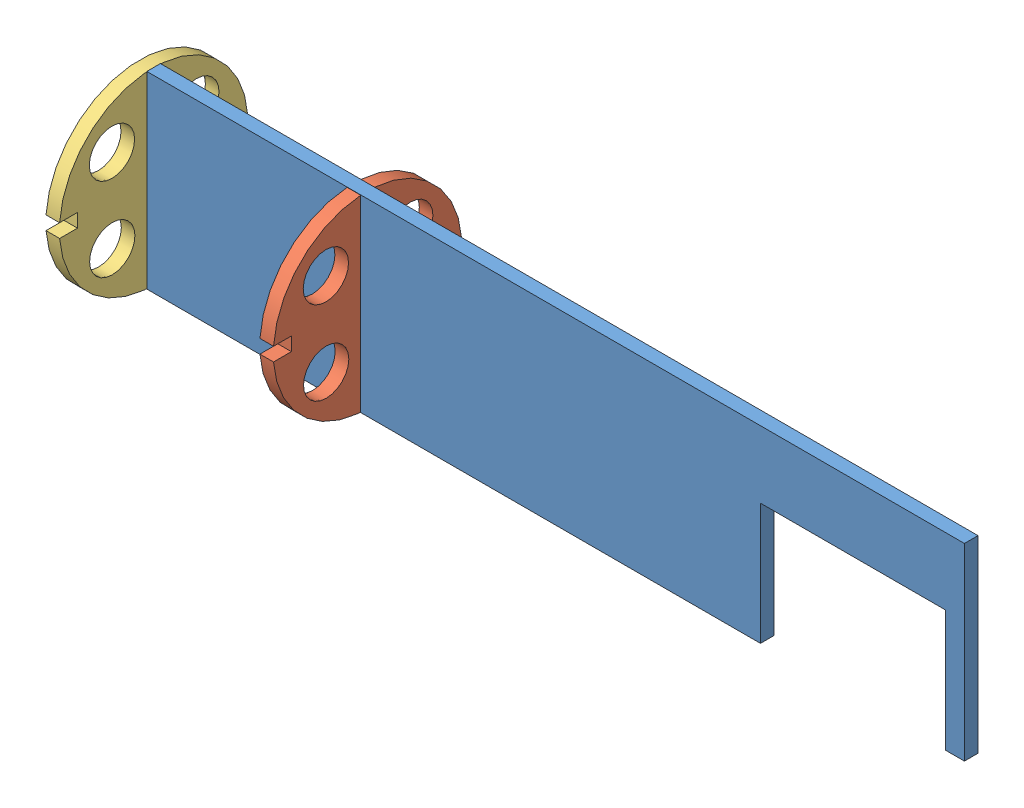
SolidWorks assembly Assem1.sldasm, configuration Default (file format 3100). Lengths in mm.
Overall size (232.92 52.83 52.69).
3 component instances, 3 part files, 10 mates.
Components (placement in the parent):
- AvionicsBed-1: AvionicsBed.SLDPRT [Default] at (112.5036 -35.703 -35.1105) size (229.11 52.83 3.81)
- DiscMid-1: DiscMid.SLDPRT [Default] at (-56.6604 -9.287 -33.2055) x (0 -1 0) z (-1 0 0) size (52.76 52.69 3.81)
- DiscForward-1: DiscForward.SLDPRT [Default] at (-116.6044 -9.287 -33.2055) x (0 -1 0) z (-1 0 0) size (52.83 52.69 3.81)
Mates (geometry in assembly coordinates):
- Parallel2: parallel anti-aligned: plane of AvionicsBed-1 through (-60.4704 -43.7603 -31.3005) normal (1 0 0); plane of DiscMid-1 through (-60.4704 -9.287 -33.2055) normal (-1 0 0)
- Parallel3: parallel anti-aligned: plane of AvionicsBed-1 through (-60.4704 -9.287 -31.3005) normal (0 -1 0); plane of DiscMid-1 through (-60.4704 -9.287 -31.3005) normal (0 1 0)
- Coincident2: coincident anti-aligned: plane of AvionicsBed-1 through (-60.4704 -43.7603 -31.3005) normal (1 0 0); plane of DiscMid-1 through (-60.4704 -9.287 -33.2055) normal (-1 0 0)
- Coincident3: coincident anti-aligned: plane of AvionicsBed-1 through (-60.4704 -9.287 -31.3005) normal (0 -1 0); plane of DiscMid-1 through (-60.4704 -9.287 -31.3005) normal (0 1 0)
- Coincident4: coincident anti-aligned: plane of AvionicsBed-1 through (112.5036 17.129 -31.3005) normal (0 0 1); plane of DiscMid-1 through (-60.4704 19.0143 -31.3005) normal (0 0 -1)
- Parallel6: parallel anti-aligned: plane of DiscMid-1; plane of DiscForward-1
- Parallel7: parallel anti-aligned: plane of DiscMid-1; plane of DiscForward-1
- Coincident7: coincident anti-aligned: plane of AvionicsBed-1; plane of DiscForward-1
- Coincident8: coincident aligned: plane of DiscMid-1; plane of DiscForward-1
- Coincident9: coincident aligned: plane of DiscMid-1; plane of DiscForward-1
